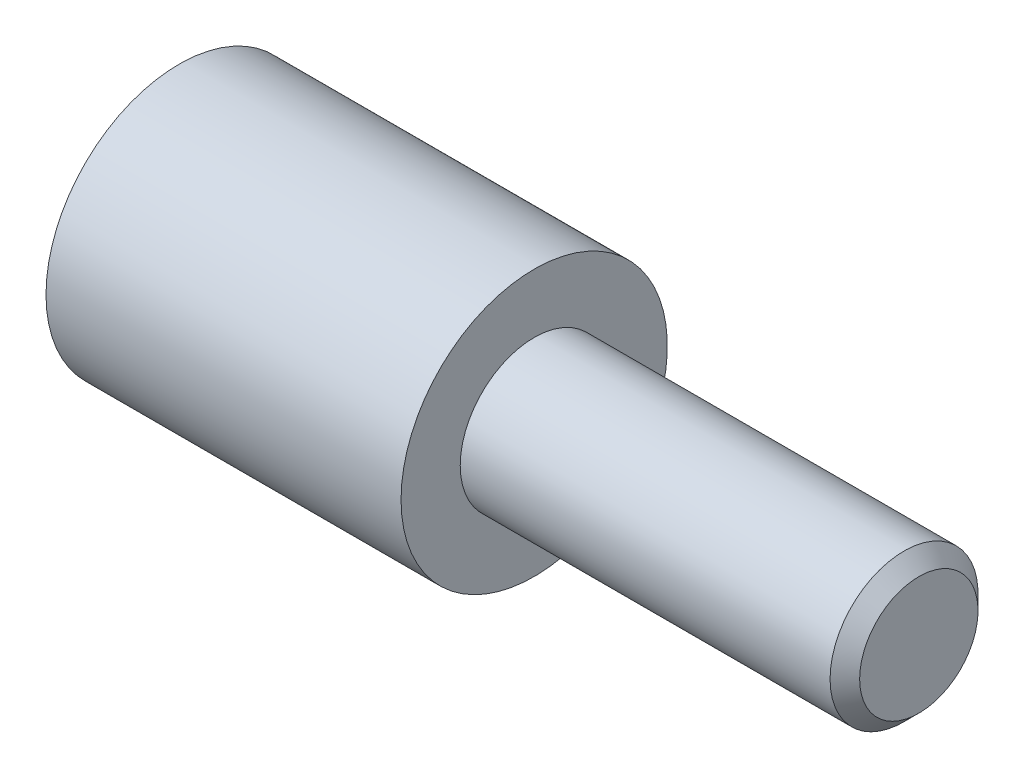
from build123d import *

# Parameters (mm, degrees)
CHANFREIN1_SIZE = 0.5


with BuildPart() as part:
    # Esquisse1 → R_volution1 (revolve)
    with BuildSketch(Plane.XY, mode=Mode.PRIVATE) as r_volution1_sk:
        Polygon((0, 2.8), (0, 4.5), (12, 4.5), (12, 2.5), (25, 2.5), (25, 0), (10, 0), (10, 2.8), align=None)
    revolve(r_volution1_sk.sketch.rotate(Axis((-11.705244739, 0, 0), (1, 0, 0)), 90), axis=Axis((-11.705244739, 0, 0), (1, 0, 0)))

    # Chanfrein1
    chanfrein1_edges = [part.edges().sort_by_distance(p)[0] for p in [
        (25, 0, -2.5),
    ]]
    chamfer(chanfrein1_edges, length=CHANFREIN1_SIZE)


solid = part.part
